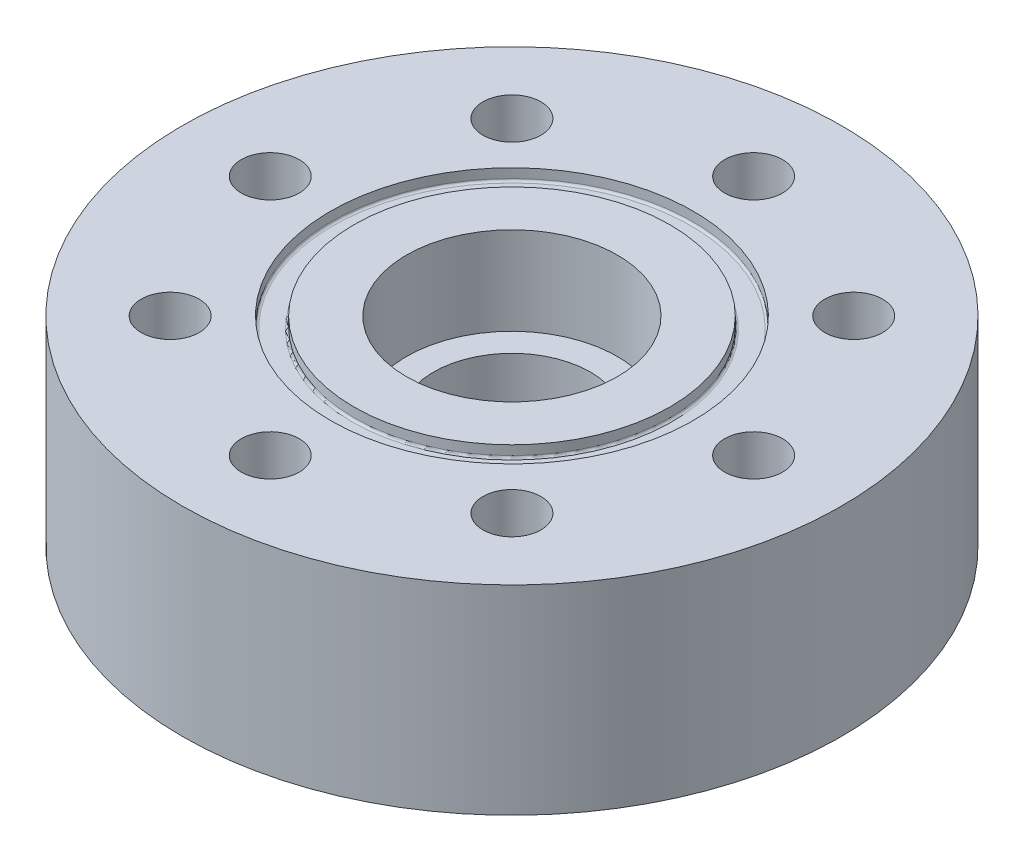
ISO-10303-21;
HEADER;
FILE_DESCRIPTION(('STEP AP214'),'2;1');
FILE_NAME('part.step','',(''),(''),'','','');
FILE_SCHEMA(('AUTOMOTIVE_DESIGN { 1 0 10303 214 1 1 1 1 }'));
ENDSEC;
DATA;
#1=APPLICATION_CONTEXT('core data for automotive mechanical design processes');
#2=APPLICATION_PROTOCOL_DEFINITION('international standard','automotive_design',2000,#1);
#3=PRODUCT_CONTEXT('',#1,'mechanical');
#4=PRODUCT('Part','Part','',(#3));
#5=PRODUCT_RELATED_PRODUCT_CATEGORY('part','',(#4));
#6=PRODUCT_DEFINITION_FORMATION('','',#4);
#7=PRODUCT_DEFINITION_CONTEXT('part definition',#1,'design');
#8=PRODUCT_DEFINITION('design','',#6,#7);
#9=PRODUCT_DEFINITION_SHAPE('','',#8);
#10=(LENGTH_UNIT() NAMED_UNIT(*) SI_UNIT(.MILLI.,.METRE.));
#11=(NAMED_UNIT(*) PLANE_ANGLE_UNIT() SI_UNIT($,.RADIAN.));
#12=(NAMED_UNIT(*) SI_UNIT($,.STERADIAN.) SOLID_ANGLE_UNIT());
#13=UNCERTAINTY_MEASURE_WITH_UNIT(LENGTH_MEASURE(1.E-05),#10,'distance_accuracy_value','');
#14=(GEOMETRIC_REPRESENTATION_CONTEXT(3) GLOBAL_UNCERTAINTY_ASSIGNED_CONTEXT((#13)) GLOBAL_UNIT_ASSIGNED_CONTEXT((#10,
#11,#12)) REPRESENTATION_CONTEXT('',''));
#15=CARTESIAN_POINT('',(0.,0.,0.));
#16=DIRECTION('',(0.,0.,1.));
#17=DIRECTION('',(1.,0.,0.));
#18=AXIS2_PLACEMENT_3D('',#15,#16,#17);
#19=CARTESIAN_POINT('',(0.,22.7,0.));
#20=DIRECTION('',(0.,-1.,0.));
#21=DIRECTION('',(0.,0.,-1.));
#22=AXIS2_PLACEMENT_3D('',#19,#20,#21);
#23=CYLINDRICAL_SURFACE('',#22,37.5);
#24=CARTESIAN_POINT('',(0.,22.7,0.));
#25=DIRECTION('',(0.,1.,0.));
#26=DIRECTION('',(0.,0.,1.));
#27=AXIS2_PLACEMENT_3D('',#24,#25,#26);
#28=CIRCLE('',#27,37.5);
#29=CARTESIAN_POINT('',(0.,22.7,37.5));
#30=VERTEX_POINT('',#29);
#31=EDGE_CURVE('E60',#30,#30,#28,.T.);
#32=ORIENTED_EDGE('',*,*,#31,.F.);
#33=EDGE_LOOP('',(#32));
#34=FACE_BOUND('',#33,.T.);
#35=CARTESIAN_POINT('',(0.,0.,0.));
#36=DIRECTION('',(0.,1.,0.));
#37=DIRECTION('',(0.,0.,1.));
#38=AXIS2_PLACEMENT_3D('',#35,#36,#37);
#39=CIRCLE('',#38,37.5);
#40=CARTESIAN_POINT('',(0.,0.,37.5));
#41=VERTEX_POINT('',#40);
#42=EDGE_CURVE('E61',#41,#41,#39,.T.);
#43=ORIENTED_EDGE('',*,*,#42,.T.);
#44=EDGE_LOOP('',(#43));
#45=FACE_BOUND('',#44,.T.);
#46=ADVANCED_FACE('F36',(#34,#45),#23,.T.);
#47=CARTESIAN_POINT('',(0.,22.7,0.));
#48=DIRECTION('',(0.,1.,0.));
#49=DIRECTION('',(0.,0.,1.));
#50=AXIS2_PLACEMENT_3D('',#47,#48,#49);
#51=PLANE('',#50);
#52=CARTESIAN_POINT('',(0.,22.7,0.));
#53=DIRECTION('',(0.,1.,0.));
#54=DIRECTION('',(0.,0.,1.));
#55=AXIS2_PLACEMENT_3D('',#52,#53,#54);
#56=CIRCLE('',#55,20.6375);
#57=CARTESIAN_POINT('',(0.,22.7,20.6375));
#58=VERTEX_POINT('',#57);
#59=EDGE_CURVE('E84',#58,#58,#56,.T.);
#60=ORIENTED_EDGE('',*,*,#59,.F.);
#61=EDGE_LOOP('',(#60));
#62=FACE_BOUND('',#61,.T.);
#63=CARTESIAN_POINT('',(-27.5,22.7,0.));
#64=DIRECTION('',(0.,-1.,0.));
#65=DIRECTION('',(0.,0.,-1.));
#66=AXIS2_PLACEMENT_3D('',#63,#64,#65);
#67=CIRCLE('',#66,3.3);
#68=CARTESIAN_POINT('',(-27.5,22.7,-3.3));
#69=VERTEX_POINT('',#68);
#70=EDGE_CURVE('E72',#69,#69,#67,.T.);
#71=ORIENTED_EDGE('',*,*,#70,.T.);
#72=EDGE_LOOP('',(#71));
#73=FACE_BOUND('',#72,.T.);
#74=CARTESIAN_POINT('',(-19.44543648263,22.7,19.4454364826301));
#75=DIRECTION('',(0.,-1.,0.));
#76=DIRECTION('',(0.,0.,-1.));
#77=AXIS2_PLACEMENT_3D('',#74,#75,#76);
#78=CIRCLE('',#77,3.30000000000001);
#79=CARTESIAN_POINT('',(-19.44543648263,22.7,16.1454364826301));
#80=VERTEX_POINT('',#79);
#81=EDGE_CURVE('E132',#80,#80,#78,.T.);
#82=ORIENTED_EDGE('',*,*,#81,.T.);
#83=EDGE_LOOP('',(#82));
#84=FACE_BOUND('',#83,.T.);
#85=CARTESIAN_POINT('',(0.,22.7,27.5));
#86=DIRECTION('',(0.,-1.,0.));
#87=DIRECTION('',(0.,0.,-1.));
#88=AXIS2_PLACEMENT_3D('',#85,#86,#87);
#89=CIRCLE('',#88,3.3);
#90=CARTESIAN_POINT('',(0.,22.7,24.2));
#91=VERTEX_POINT('',#90);
#92=EDGE_CURVE('E124',#91,#91,#89,.T.);
#93=ORIENTED_EDGE('',*,*,#92,.T.);
#94=EDGE_LOOP('',(#93));
#95=FACE_BOUND('',#94,.T.);
#96=CARTESIAN_POINT('',(19.4454364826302,22.7,19.44543648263));
#97=DIRECTION('',(0.,-1.,0.));
#98=DIRECTION('',(0.,0.,-1.));
#99=AXIS2_PLACEMENT_3D('',#96,#97,#98);
#100=CIRCLE('',#99,3.3);
#101=CARTESIAN_POINT('',(19.4454364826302,22.7,16.14543648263));
#102=VERTEX_POINT('',#101);
#103=EDGE_CURVE('E116',#102,#102,#100,.T.);
#104=ORIENTED_EDGE('',*,*,#103,.T.);
#105=EDGE_LOOP('',(#104));
#106=FACE_BOUND('',#105,.T.);
#107=CARTESIAN_POINT('',(27.5,22.7,-1.92031473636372E-13));
#108=DIRECTION('',(0.,-1.,0.));
#109=DIRECTION('',(0.,0.,-1.));
#110=AXIS2_PLACEMENT_3D('',#107,#108,#109);
#111=CIRCLE('',#110,3.3);
#112=CARTESIAN_POINT('',(27.5,22.7,-3.30000000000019));
#113=VERTEX_POINT('',#112);
#114=EDGE_CURVE('E108',#113,#113,#111,.T.);
#115=ORIENTED_EDGE('',*,*,#114,.T.);
#116=EDGE_LOOP('',(#115));
#117=FACE_BOUND('',#116,.T.);
#118=CARTESIAN_POINT('',(19.4454364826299,22.7,-19.4454364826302));
#119=DIRECTION('',(0.,-1.,0.));
#120=DIRECTION('',(0.,0.,-1.));
#121=AXIS2_PLACEMENT_3D('',#118,#119,#120);
#122=CIRCLE('',#121,3.3);
#123=CARTESIAN_POINT('',(19.4454364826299,22.7,-22.7454364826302));
#124=VERTEX_POINT('',#123);
#125=EDGE_CURVE('E100',#124,#124,#122,.T.);
#126=ORIENTED_EDGE('',*,*,#125,.T.);
#127=EDGE_LOOP('',(#126));
#128=FACE_BOUND('',#127,.T.);
#129=CARTESIAN_POINT('',(-2.88047210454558E-13,22.7,-27.5));
#130=DIRECTION('',(0.,-1.,0.));
#131=DIRECTION('',(0.,0.,-1.));
#132=AXIS2_PLACEMENT_3D('',#129,#130,#131);
#133=CIRCLE('',#132,3.3);
#134=CARTESIAN_POINT('',(-2.88047210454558E-13,22.7,-30.8));
#135=VERTEX_POINT('',#134);
#136=EDGE_CURVE('E92',#135,#135,#133,.T.);
#137=ORIENTED_EDGE('',*,*,#136,.T.);
#138=EDGE_LOOP('',(#137));
#139=FACE_BOUND('',#138,.T.);
#140=CARTESIAN_POINT('',(-19.4454364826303,22.7,-19.4454364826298));
#141=DIRECTION('',(0.,-1.,0.));
#142=DIRECTION('',(0.,0.,-1.));
#143=AXIS2_PLACEMENT_3D('',#140,#141,#142);
#144=CIRCLE('',#143,3.3);
#145=CARTESIAN_POINT('',(-19.4454364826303,22.7,-22.7454364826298));
#146=VERTEX_POINT('',#145);
#147=EDGE_CURVE('E83',#146,#146,#144,.T.);
#148=ORIENTED_EDGE('',*,*,#147,.T.);
#149=EDGE_LOOP('',(#148));
#150=FACE_BOUND('',#149,.T.);
#151=ORIENTED_EDGE('',*,*,#31,.T.);
#152=EDGE_LOOP('',(#151));
#153=FACE_BOUND('',#152,.T.);
#154=ADVANCED_FACE('F172',(#62,#73,#84,#95,#106,#117,#128,#139,#150,#153),#51,.T.);
#155=CARTESIAN_POINT('',(0.,0.,0.));
#156=DIRECTION('',(0.,1.,0.));
#157=DIRECTION('',(0.,0.,1.));
#158=AXIS2_PLACEMENT_3D('',#155,#156,#157);
#159=PLANE('',#158);
#160=CARTESIAN_POINT('',(-27.5,0.,0.));
#161=DIRECTION('',(0.,-1.,0.));
#162=DIRECTION('',(0.,0.,-1.));
#163=AXIS2_PLACEMENT_3D('',#160,#161,#162);
#164=CIRCLE('',#163,3.3);
#165=CARTESIAN_POINT('',(-27.5,0.,-3.3));
#166=VERTEX_POINT('',#165);
#167=EDGE_CURVE('E136',#166,#166,#164,.T.);
#168=ORIENTED_EDGE('',*,*,#167,.F.);
#169=EDGE_LOOP('',(#168));
#170=FACE_BOUND('',#169,.T.);
#171=CARTESIAN_POINT('',(-19.44543648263,0.,19.4454364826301));
#172=DIRECTION('',(0.,-1.,0.));
#173=DIRECTION('',(0.,0.,-1.));
#174=AXIS2_PLACEMENT_3D('',#171,#172,#173);
#175=CIRCLE('',#174,3.30000000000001);
#176=CARTESIAN_POINT('',(-19.44543648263,0.,16.1454364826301));
#177=VERTEX_POINT('',#176);
#178=EDGE_CURVE('E128',#177,#177,#175,.T.);
#179=ORIENTED_EDGE('',*,*,#178,.F.);
#180=EDGE_LOOP('',(#179));
#181=FACE_BOUND('',#180,.T.);
#182=CARTESIAN_POINT('',(0.,0.,27.5));
#183=DIRECTION('',(0.,-1.,0.));
#184=DIRECTION('',(0.,0.,-1.));
#185=AXIS2_PLACEMENT_3D('',#182,#183,#184);
#186=CIRCLE('',#185,3.3);
#187=CARTESIAN_POINT('',(0.,0.,24.2));
#188=VERTEX_POINT('',#187);
#189=EDGE_CURVE('E120',#188,#188,#186,.T.);
#190=ORIENTED_EDGE('',*,*,#189,.F.);
#191=EDGE_LOOP('',(#190));
#192=FACE_BOUND('',#191,.T.);
#193=CARTESIAN_POINT('',(19.4454364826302,0.,19.44543648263));
#194=DIRECTION('',(0.,-1.,0.));
#195=DIRECTION('',(0.,0.,-1.));
#196=AXIS2_PLACEMENT_3D('',#193,#194,#195);
#197=CIRCLE('',#196,3.3);
#198=CARTESIAN_POINT('',(19.4454364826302,0.,16.14543648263));
#199=VERTEX_POINT('',#198);
#200=EDGE_CURVE('E112',#199,#199,#197,.T.);
#201=ORIENTED_EDGE('',*,*,#200,.F.);
#202=EDGE_LOOP('',(#201));
#203=FACE_BOUND('',#202,.T.);
#204=CARTESIAN_POINT('',(27.5,0.,-1.92031473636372E-13));
#205=DIRECTION('',(0.,-1.,0.));
#206=DIRECTION('',(0.,0.,-1.));
#207=AXIS2_PLACEMENT_3D('',#204,#205,#206);
#208=CIRCLE('',#207,3.3);
#209=CARTESIAN_POINT('',(27.5,0.,-3.30000000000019));
#210=VERTEX_POINT('',#209);
#211=EDGE_CURVE('E104',#210,#210,#208,.T.);
#212=ORIENTED_EDGE('',*,*,#211,.F.);
#213=EDGE_LOOP('',(#212));
#214=FACE_BOUND('',#213,.T.);
#215=CARTESIAN_POINT('',(19.4454364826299,0.,-19.4454364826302));
#216=DIRECTION('',(0.,-1.,0.));
#217=DIRECTION('',(0.,0.,-1.));
#218=AXIS2_PLACEMENT_3D('',#215,#216,#217);
#219=CIRCLE('',#218,3.3);
#220=CARTESIAN_POINT('',(19.4454364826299,0.,-22.7454364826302));
#221=VERTEX_POINT('',#220);
#222=EDGE_CURVE('E96',#221,#221,#219,.T.);
#223=ORIENTED_EDGE('',*,*,#222,.F.);
#224=EDGE_LOOP('',(#223));
#225=FACE_BOUND('',#224,.T.);
#226=CARTESIAN_POINT('',(-2.88047210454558E-13,0.,-27.5));
#227=DIRECTION('',(0.,-1.,0.));
#228=DIRECTION('',(0.,0.,-1.));
#229=AXIS2_PLACEMENT_3D('',#226,#227,#228);
#230=CIRCLE('',#229,3.3);
#231=CARTESIAN_POINT('',(-2.88047210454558E-13,0.,-30.8));
#232=VERTEX_POINT('',#231);
#233=EDGE_CURVE('E88',#232,#232,#230,.T.);
#234=ORIENTED_EDGE('',*,*,#233,.F.);
#235=EDGE_LOOP('',(#234));
#236=FACE_BOUND('',#235,.T.);
#237=CARTESIAN_POINT('',(-19.4454364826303,0.,-19.4454364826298));
#238=DIRECTION('',(0.,-1.,0.));
#239=DIRECTION('',(0.,0.,-1.));
#240=AXIS2_PLACEMENT_3D('',#237,#238,#239);
#241=CIRCLE('',#240,3.3);
#242=CARTESIAN_POINT('',(-19.4454364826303,0.,-22.7454364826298));
#243=VERTEX_POINT('',#242);
#244=EDGE_CURVE('E79',#243,#243,#241,.T.);
#245=ORIENTED_EDGE('',*,*,#244,.F.);
#246=EDGE_LOOP('',(#245));
#247=FACE_BOUND('',#246,.T.);
#248=CARTESIAN_POINT('',(0.,0.,0.));
#249=DIRECTION('',(0.,-1.,0.));
#250=DIRECTION('',(0.,0.,-1.));
#251=AXIS2_PLACEMENT_3D('',#248,#249,#250);
#252=CIRCLE('',#251,8.93);
#253=CARTESIAN_POINT('',(0.,0.,-8.93));
#254=VERTEX_POINT('',#253);
#255=EDGE_CURVE('E65',#254,#254,#252,.T.);
#256=ORIENTED_EDGE('',*,*,#255,.F.);
#257=EDGE_LOOP('',(#256));
#258=FACE_BOUND('',#257,.T.);
#259=ORIENTED_EDGE('',*,*,#42,.F.);
#260=EDGE_LOOP('',(#259));
#261=FACE_BOUND('',#260,.T.);
#262=ADVANCED_FACE('F192',(#170,#181,#192,#203,#214,#225,#236,#247,#258,#261),#159,.F.);
#263=CARTESIAN_POINT('',(0.,12.7,0.));
#264=DIRECTION('',(0.,-1.,0.));
#265=DIRECTION('',(0.,0.,-1.));
#266=AXIS2_PLACEMENT_3D('',#263,#264,#265);
#267=CYLINDRICAL_SURFACE('',#266,8.93);
#268=CARTESIAN_POINT('',(0.,12.7,0.));
#269=DIRECTION('',(0.,-1.,0.));
#270=DIRECTION('',(0.,0.,-1.));
#271=AXIS2_PLACEMENT_3D('',#268,#269,#270);
#272=CIRCLE('',#271,8.93);
#273=CARTESIAN_POINT('',(0.,12.7,-8.93));
#274=VERTEX_POINT('',#273);
#275=EDGE_CURVE('E73',#274,#274,#272,.T.);
#276=ORIENTED_EDGE('',*,*,#275,.F.);
#277=EDGE_LOOP('',(#276));
#278=FACE_BOUND('',#277,.T.);
#279=ORIENTED_EDGE('',*,*,#255,.T.);
#280=EDGE_LOOP('',(#279));
#281=FACE_BOUND('',#280,.T.);
#282=ADVANCED_FACE('F323',(#278,#281),#267,.F.);
#283=CARTESIAN_POINT('',(-19.4454364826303,22.7,-19.4454364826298));
#284=DIRECTION('',(0.,-1.,0.));
#285=DIRECTION('',(0.,0.,-1.));
#286=AXIS2_PLACEMENT_3D('',#283,#284,#285);
#287=CYLINDRICAL_SURFACE('',#286,3.3);
#288=ORIENTED_EDGE('',*,*,#147,.F.);
#289=EDGE_LOOP('',(#288));
#290=FACE_BOUND('',#289,.T.);
#291=ORIENTED_EDGE('',*,*,#244,.T.);
#292=EDGE_LOOP('',(#291));
#293=FACE_BOUND('',#292,.T.);
#294=ADVANCED_FACE('F314',(#290,#293),#287,.F.);
#295=CARTESIAN_POINT('',(-2.88047210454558E-13,22.7,-27.5));
#296=DIRECTION('',(0.,-1.,0.));
#297=DIRECTION('',(0.,0.,-1.));
#298=AXIS2_PLACEMENT_3D('',#295,#296,#297);
#299=CYLINDRICAL_SURFACE('',#298,3.3);
#300=ORIENTED_EDGE('',*,*,#136,.F.);
#301=EDGE_LOOP('',(#300));
#302=FACE_BOUND('',#301,.T.);
#303=ORIENTED_EDGE('',*,*,#233,.T.);
#304=EDGE_LOOP('',(#303));
#305=FACE_BOUND('',#304,.T.);
#306=ADVANCED_FACE('F305',(#302,#305),#299,.F.);
#307=CARTESIAN_POINT('',(19.4454364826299,22.7,-19.4454364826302));
#308=DIRECTION('',(0.,-1.,0.));
#309=DIRECTION('',(0.,0.,-1.));
#310=AXIS2_PLACEMENT_3D('',#307,#308,#309);
#311=CYLINDRICAL_SURFACE('',#310,3.3);
#312=ORIENTED_EDGE('',*,*,#125,.F.);
#313=EDGE_LOOP('',(#312));
#314=FACE_BOUND('',#313,.T.);
#315=ORIENTED_EDGE('',*,*,#222,.T.);
#316=EDGE_LOOP('',(#315));
#317=FACE_BOUND('',#316,.T.);
#318=ADVANCED_FACE('F296',(#314,#317),#311,.F.);
#319=CARTESIAN_POINT('',(27.5,22.7,-1.92031473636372E-13));
#320=DIRECTION('',(0.,-1.,0.));
#321=DIRECTION('',(0.,0.,-1.));
#322=AXIS2_PLACEMENT_3D('',#319,#320,#321);
#323=CYLINDRICAL_SURFACE('',#322,3.3);
#324=ORIENTED_EDGE('',*,*,#114,.F.);
#325=EDGE_LOOP('',(#324));
#326=FACE_BOUND('',#325,.T.);
#327=ORIENTED_EDGE('',*,*,#211,.T.);
#328=EDGE_LOOP('',(#327));
#329=FACE_BOUND('',#328,.T.);
#330=ADVANCED_FACE('F287',(#326,#329),#323,.F.);
#331=CARTESIAN_POINT('',(19.4454364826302,22.7,19.44543648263));
#332=DIRECTION('',(0.,-1.,0.));
#333=DIRECTION('',(0.,0.,-1.));
#334=AXIS2_PLACEMENT_3D('',#331,#332,#333);
#335=CYLINDRICAL_SURFACE('',#334,3.3);
#336=ORIENTED_EDGE('',*,*,#103,.F.);
#337=EDGE_LOOP('',(#336));
#338=FACE_BOUND('',#337,.T.);
#339=ORIENTED_EDGE('',*,*,#200,.T.);
#340=EDGE_LOOP('',(#339));
#341=FACE_BOUND('',#340,.T.);
#342=ADVANCED_FACE('F278',(#338,#341),#335,.F.);
#343=CARTESIAN_POINT('',(0.,22.7,27.5));
#344=DIRECTION('',(0.,-1.,0.));
#345=DIRECTION('',(0.,0.,-1.));
#346=AXIS2_PLACEMENT_3D('',#343,#344,#345);
#347=CYLINDRICAL_SURFACE('',#346,3.3);
#348=ORIENTED_EDGE('',*,*,#92,.F.);
#349=EDGE_LOOP('',(#348));
#350=FACE_BOUND('',#349,.T.);
#351=ORIENTED_EDGE('',*,*,#189,.T.);
#352=EDGE_LOOP('',(#351));
#353=FACE_BOUND('',#352,.T.);
#354=ADVANCED_FACE('F269',(#350,#353),#347,.F.);
#355=CARTESIAN_POINT('',(-19.44543648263,22.7,19.4454364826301));
#356=DIRECTION('',(0.,-1.,0.));
#357=DIRECTION('',(0.,0.,-1.));
#358=AXIS2_PLACEMENT_3D('',#355,#356,#357);
#359=CYLINDRICAL_SURFACE('',#358,3.30000000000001);
#360=ORIENTED_EDGE('',*,*,#81,.F.);
#361=EDGE_LOOP('',(#360));
#362=FACE_BOUND('',#361,.T.);
#363=ORIENTED_EDGE('',*,*,#178,.T.);
#364=EDGE_LOOP('',(#363));
#365=FACE_BOUND('',#364,.T.);
#366=ADVANCED_FACE('F260',(#362,#365),#359,.F.);
#367=CARTESIAN_POINT('',(-27.5,22.7,0.));
#368=DIRECTION('',(0.,-1.,0.));
#369=DIRECTION('',(0.,0.,-1.));
#370=AXIS2_PLACEMENT_3D('',#367,#368,#369);
#371=CYLINDRICAL_SURFACE('',#370,3.3);
#372=ORIENTED_EDGE('',*,*,#70,.F.);
#373=EDGE_LOOP('',(#372));
#374=FACE_BOUND('',#373,.T.);
#375=ORIENTED_EDGE('',*,*,#167,.T.);
#376=EDGE_LOOP('',(#375));
#377=FACE_BOUND('',#376,.T.);
#378=ADVANCED_FACE('F246',(#374,#377),#371,.F.);
#379=CARTESIAN_POINT('',(0.,21.3792,0.));
#380=DIRECTION('',(0.,1.,0.));
#381=DIRECTION('',(0.,0.,1.));
#382=AXIS2_PLACEMENT_3D('',#379,#380,#381);
#383=CYLINDRICAL_SURFACE('',#382,20.6375);
#384=CARTESIAN_POINT('',(0.,21.6332,0.));
#385=DIRECTION('',(0.,1.,0.));
#386=DIRECTION('',(0.,0.,1.));
#387=AXIS2_PLACEMENT_3D('',#384,#385,#386);
#388=CIRCLE('',#387,20.6375);
#389=CARTESIAN_POINT('',(0.,21.6332,20.6375));
#390=VERTEX_POINT('',#389);
#391=EDGE_CURVE('E10',#390,#390,#388,.F.);
#392=ORIENTED_EDGE('',*,*,#391,.T.);
#393=EDGE_LOOP('',(#392));
#394=FACE_BOUND('',#393,.T.);
#395=ORIENTED_EDGE('',*,*,#59,.T.);
#396=EDGE_LOOP('',(#395));
#397=FACE_BOUND('',#396,.T.);
#398=ADVANCED_FACE('F183',(#394,#397),#383,.F.);
#399=CARTESIAN_POINT('',(0.,21.3792,0.));
#400=DIRECTION('',(0.,1.,0.));
#401=DIRECTION('',(0.,0.,1.));
#402=AXIS2_PLACEMENT_3D('',#399,#400,#401);
#403=PLANE('',#402);
#404=CARTESIAN_POINT('',(0.,21.3792,0.));
#405=DIRECTION('',(0.,1.,0.));
#406=DIRECTION('',(0.,0.,1.));
#407=AXIS2_PLACEMENT_3D('',#404,#405,#406);
#408=CIRCLE('',#407,18.2245);
#409=CARTESIAN_POINT('',(0.,21.3792,18.2245));
#410=VERTEX_POINT('',#409);
#411=EDGE_CURVE('E44',#410,#410,#408,.F.);
#412=ORIENTED_EDGE('',*,*,#411,.T.);
#413=EDGE_LOOP('',(#412));
#414=FACE_BOUND('',#413,.T.);
#415=CARTESIAN_POINT('',(0.,21.3792,0.));
#416=DIRECTION('',(0.,1.,0.));
#417=DIRECTION('',(0.,0.,1.));
#418=AXIS2_PLACEMENT_3D('',#415,#416,#417);
#419=CIRCLE('',#418,20.3835);
#420=CARTESIAN_POINT('',(0.,21.3792,20.3835));
#421=VERTEX_POINT('',#420);
#422=EDGE_CURVE('E49',#421,#421,#419,.T.);
#423=ORIENTED_EDGE('',*,*,#422,.T.);
#424=EDGE_LOOP('',(#423));
#425=FACE_BOUND('',#424,.T.);
#426=ADVANCED_FACE('F176',(#414,#425),#403,.T.);
#427=CARTESIAN_POINT('',(0.,21.3792,0.));
#428=DIRECTION('',(0.,1.,0.));
#429=DIRECTION('',(0.,0.,1.));
#430=AXIS2_PLACEMENT_3D('',#427,#428,#429);
#431=CYLINDRICAL_SURFACE('',#430,17.9705);
#432=CARTESIAN_POINT('',(0.,21.6332,0.));
#433=DIRECTION('',(0.,1.,0.));
#434=DIRECTION('',(0.,0.,1.));
#435=AXIS2_PLACEMENT_3D('',#432,#433,#434);
#436=CIRCLE('',#435,17.9705);
#437=CARTESIAN_POINT('',(0.,21.6332,17.9705));
#438=VERTEX_POINT('',#437);
#439=EDGE_CURVE('E54',#438,#438,#436,.T.);
#440=ORIENTED_EDGE('',*,*,#439,.T.);
#441=EDGE_LOOP('',(#440));
#442=FACE_BOUND('',#441,.T.);
#443=CARTESIAN_POINT('',(0.,22.7,0.));
#444=DIRECTION('',(0.,1.,0.));
#445=DIRECTION('',(0.,0.,1.));
#446=AXIS2_PLACEMENT_3D('',#443,#444,#445);
#447=CIRCLE('',#446,17.9705);
#448=CARTESIAN_POINT('',(0.,22.7,17.9705));
#449=VERTEX_POINT('',#448);
#450=EDGE_CURVE('E77',#449,#449,#447,.T.);
#451=ORIENTED_EDGE('',*,*,#450,.F.);
#452=EDGE_LOOP('',(#451));
#453=FACE_BOUND('',#452,.T.);
#454=ADVANCED_FACE('F170',(#442,#453),#431,.T.);
#455=CARTESIAN_POINT('',(0.,22.7,0.));
#456=DIRECTION('',(0.,1.,0.));
#457=DIRECTION('',(0.,0.,1.));
#458=AXIS2_PLACEMENT_3D('',#455,#456,#457);
#459=CIRCLE('',#458,12.);
#460=CARTESIAN_POINT('',(0.,22.7,12.));
#461=VERTEX_POINT('',#460);
#462=EDGE_CURVE('E149',#461,#461,#459,.T.);
#463=ORIENTED_EDGE('',*,*,#462,.F.);
#464=EDGE_LOOP('',(#463));
#465=FACE_BOUND('',#464,.T.);
#466=ORIENTED_EDGE('',*,*,#450,.T.);
#467=EDGE_LOOP('',(#466));
#468=FACE_BOUND('',#467,.T.);
#469=ADVANCED_FACE('F166',(#465,#468),#51,.T.);
#470=CARTESIAN_POINT('',(0.,21.6332,0.));
#471=DIRECTION('',(0.,1.,0.));
#472=DIRECTION('',(0.,0.,1.));
#473=AXIS2_PLACEMENT_3D('',#470,#471,#472);
#474=TOROIDAL_SURFACE('',#473,18.2245,0.254);
#475=ORIENTED_EDGE('',*,*,#411,.F.);
#476=EDGE_LOOP('',(#475));
#477=FACE_BOUND('',#476,.T.);
#478=ORIENTED_EDGE('',*,*,#439,.F.);
#479=EDGE_LOOP('',(#478));
#480=FACE_BOUND('',#479,.T.);
#481=ADVANCED_FACE('F169',(#477,#480),#474,.F.);
#482=CARTESIAN_POINT('',(0.,21.6332,0.));
#483=DIRECTION('',(0.,1.,0.));
#484=DIRECTION('',(0.,0.,1.));
#485=AXIS2_PLACEMENT_3D('',#482,#483,#484);
#486=TOROIDAL_SURFACE('',#485,20.3835,0.254);
#487=ORIENTED_EDGE('',*,*,#391,.F.);
#488=EDGE_LOOP('',(#487));
#489=FACE_BOUND('',#488,.T.);
#490=ORIENTED_EDGE('',*,*,#422,.F.);
#491=EDGE_LOOP('',(#490));
#492=FACE_BOUND('',#491,.T.);
#493=ADVANCED_FACE('F38',(#489,#492),#486,.F.);
#494=CARTESIAN_POINT('',(0.,12.7,0.));
#495=DIRECTION('',(0.,1.,0.));
#496=DIRECTION('',(0.,0.,1.));
#497=AXIS2_PLACEMENT_3D('',#494,#495,#496);
#498=PLANE('',#497);
#499=CARTESIAN_POINT('',(0.,12.7,0.));
#500=DIRECTION('',(0.,1.,0.));
#501=DIRECTION('',(0.,0.,1.));
#502=AXIS2_PLACEMENT_3D('',#499,#500,#501);
#503=CIRCLE('',#502,12.);
#504=CARTESIAN_POINT('',(0.,12.7,12.));
#505=VERTEX_POINT('',#504);
#506=EDGE_CURVE('E78',#505,#505,#503,.T.);
#507=ORIENTED_EDGE('',*,*,#506,.T.);
#508=EDGE_LOOP('',(#507));
#509=FACE_BOUND('',#508,.T.);
#510=ORIENTED_EDGE('',*,*,#275,.T.);
#511=EDGE_LOOP('',(#510));
#512=FACE_BOUND('',#511,.T.);
#513=ADVANCED_FACE('F157',(#509,#512),#498,.T.);
#514=CARTESIAN_POINT('',(0.,12.7,0.));
#515=DIRECTION('',(0.,1.,0.));
#516=DIRECTION('',(0.,0.,1.));
#517=AXIS2_PLACEMENT_3D('',#514,#515,#516);
#518=CYLINDRICAL_SURFACE('',#517,12.);
#519=ORIENTED_EDGE('',*,*,#506,.F.);
#520=EDGE_LOOP('',(#519));
#521=FACE_BOUND('',#520,.T.);
#522=ORIENTED_EDGE('',*,*,#462,.T.);
#523=EDGE_LOOP('',(#522));
#524=FACE_BOUND('',#523,.T.);
#525=ADVANCED_FACE('F160',(#521,#524),#518,.F.);
#526=CLOSED_SHELL('',(#46,#154,#262,#282,#294,#306,#318,#330,#342,#354,#366,#378,#398,#426,#454,
#469,#481,#493,#513,#525));
#527=MANIFOLD_SOLID_BREP('B2',#526);
#528=ADVANCED_BREP_SHAPE_REPRESENTATION('',(#18,#527),#14);
#529=SHAPE_DEFINITION_REPRESENTATION(#9,#528);
ENDSEC;
END-ISO-10303-21;
